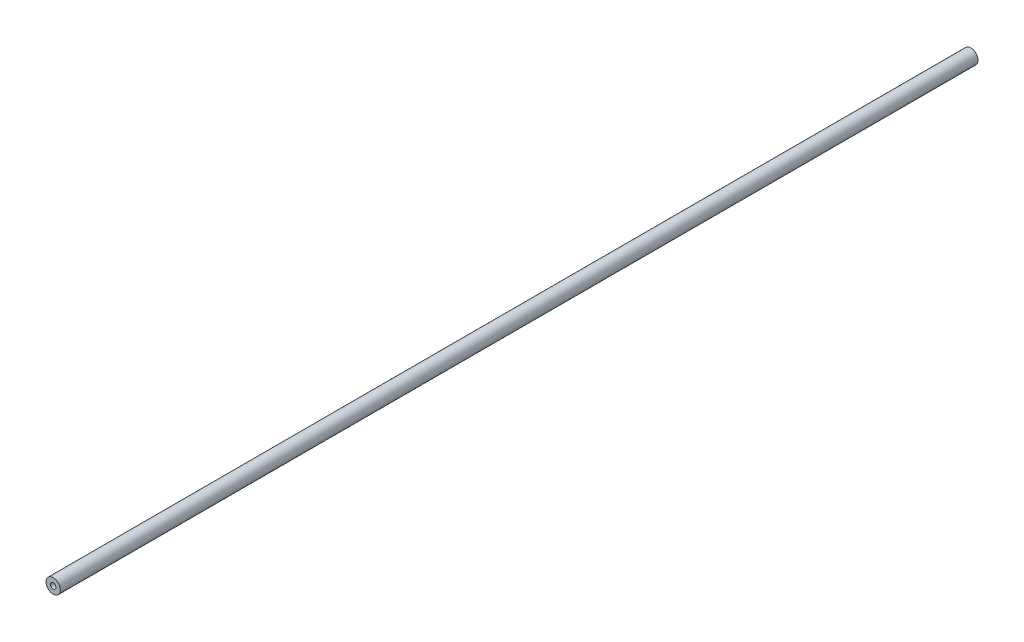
ISO-10303-21;
HEADER;
FILE_DESCRIPTION(('STEP AP214'),'2;1');
FILE_NAME('part.step','',(''),(''),'','','');
FILE_SCHEMA(('AUTOMOTIVE_DESIGN { 1 0 10303 214 1 1 1 1 }'));
ENDSEC;
DATA;
#1=APPLICATION_CONTEXT('core data for automotive mechanical design processes');
#2=APPLICATION_PROTOCOL_DEFINITION('international standard','automotive_design',2000,#1);
#3=PRODUCT_CONTEXT('',#1,'mechanical');
#4=PRODUCT('Part','Part','',(#3));
#5=PRODUCT_RELATED_PRODUCT_CATEGORY('part','',(#4));
#6=PRODUCT_DEFINITION_FORMATION('','',#4);
#7=PRODUCT_DEFINITION_CONTEXT('part definition',#1,'design');
#8=PRODUCT_DEFINITION('design','',#6,#7);
#9=PRODUCT_DEFINITION_SHAPE('','',#8);
#10=(LENGTH_UNIT() NAMED_UNIT(*) SI_UNIT(.MILLI.,.METRE.));
#11=(NAMED_UNIT(*) PLANE_ANGLE_UNIT() SI_UNIT($,.RADIAN.));
#12=(NAMED_UNIT(*) SI_UNIT($,.STERADIAN.) SOLID_ANGLE_UNIT());
#13=UNCERTAINTY_MEASURE_WITH_UNIT(LENGTH_MEASURE(1.E-05),#10,'distance_accuracy_value','');
#14=(GEOMETRIC_REPRESENTATION_CONTEXT(3) GLOBAL_UNCERTAINTY_ASSIGNED_CONTEXT((#13)) GLOBAL_UNIT_ASSIGNED_CONTEXT((#10,
#11,#12)) REPRESENTATION_CONTEXT('',''));
#15=CARTESIAN_POINT('',(0.,0.,0.));
#16=DIRECTION('',(0.,0.,1.));
#17=DIRECTION('',(1.,0.,0.));
#18=AXIS2_PLACEMENT_3D('',#15,#16,#17);
#19=CARTESIAN_POINT('',(0.,0.,609.6));
#20=DIRECTION('',(0.,0.,1.));
#21=DIRECTION('',(1.,0.,0.));
#22=AXIS2_PLACEMENT_3D('',#19,#20,#21);
#23=PLANE('',#22);
#24=CARTESIAN_POINT('',(0.,0.,609.6));
#25=DIRECTION('',(0.,0.,1.));
#26=DIRECTION('',(1.,0.,0.));
#27=AXIS2_PLACEMENT_3D('',#24,#25,#26);
#28=CIRCLE('',#27,4.7625);
#29=CARTESIAN_POINT('',(-4.7625,0.,609.6));
#30=VERTEX_POINT('',#29);
#31=EDGE_CURVE('E10',#30,#30,#28,.T.);
#32=ORIENTED_EDGE('',*,*,#31,.T.);
#33=EDGE_LOOP('',(#32));
#34=FACE_BOUND('',#33,.T.);
#35=CARTESIAN_POINT('',(0.,0.,609.6));
#36=DIRECTION('',(0.,0.,1.));
#37=DIRECTION('',(1.,0.,0.));
#38=AXIS2_PLACEMENT_3D('',#35,#36,#37);
#39=CIRCLE('',#38,1.8415);
#40=CARTESIAN_POINT('',(-1.8415,0.,609.6));
#41=VERTEX_POINT('',#40);
#42=EDGE_CURVE('E44',#41,#41,#39,.T.);
#43=ORIENTED_EDGE('',*,*,#42,.F.);
#44=EDGE_LOOP('',(#43));
#45=FACE_BOUND('',#44,.T.);
#46=ADVANCED_FACE('F33',(#34,#45),#23,.T.);
#47=CARTESIAN_POINT('',(0.,0.,0.));
#48=DIRECTION('',(0.,0.,1.));
#49=DIRECTION('',(1.,0.,0.));
#50=AXIS2_PLACEMENT_3D('',#47,#48,#49);
#51=PLANE('',#50);
#52=CARTESIAN_POINT('',(0.,0.,0.));
#53=DIRECTION('',(0.,0.,1.));
#54=DIRECTION('',(1.,0.,0.));
#55=AXIS2_PLACEMENT_3D('',#52,#53,#54);
#56=CIRCLE('',#55,4.7625);
#57=CARTESIAN_POINT('',(-4.7625,0.,0.));
#58=VERTEX_POINT('',#57);
#59=EDGE_CURVE('E37',#58,#58,#56,.T.);
#60=ORIENTED_EDGE('',*,*,#59,.F.);
#61=EDGE_LOOP('',(#60));
#62=FACE_BOUND('',#61,.T.);
#63=CARTESIAN_POINT('',(0.,0.,0.));
#64=DIRECTION('',(0.,0.,1.));
#65=DIRECTION('',(1.,0.,0.));
#66=AXIS2_PLACEMENT_3D('',#63,#64,#65);
#67=CIRCLE('',#66,1.8415);
#68=CARTESIAN_POINT('',(-1.8415,0.,0.));
#69=VERTEX_POINT('',#68);
#70=EDGE_CURVE('E46',#69,#69,#67,.T.);
#71=ORIENTED_EDGE('',*,*,#70,.T.);
#72=EDGE_LOOP('',(#71));
#73=FACE_BOUND('',#72,.T.);
#74=ADVANCED_FACE('F56',(#62,#73),#51,.F.);
#75=CARTESIAN_POINT('',(0.,0.,609.6));
#76=DIRECTION('',(0.,0.,-1.));
#77=DIRECTION('',(-1.,0.,0.));
#78=AXIS2_PLACEMENT_3D('',#75,#76,#77);
#79=CYLINDRICAL_SURFACE('',#78,4.7625);
#80=CARTESIAN_POINT('',(-4.7625,0.,609.6));
#81=CARTESIAN_POINT('',(-4.7625,0.,603.25));
#82=CARTESIAN_POINT('',(-4.7625,0.,596.9));
#83=CARTESIAN_POINT('',(-4.7625,0.,584.2));
#84=CARTESIAN_POINT('',(-4.7625,0.,577.85));
#85=CARTESIAN_POINT('',(-4.7625,0.,565.15));
#86=CARTESIAN_POINT('',(-4.7625,0.,558.8));
#87=CARTESIAN_POINT('',(-4.7625,0.,546.1));
#88=CARTESIAN_POINT('',(-4.7625,0.,539.75));
#89=CARTESIAN_POINT('',(-4.7625,0.,527.05));
#90=CARTESIAN_POINT('',(-4.7625,0.,520.7));
#91=CARTESIAN_POINT('',(-4.7625,0.,508.));
#92=CARTESIAN_POINT('',(-4.7625,0.,501.65));
#93=CARTESIAN_POINT('',(-4.7625,0.,488.95));
#94=CARTESIAN_POINT('',(-4.7625,0.,482.6));
#95=CARTESIAN_POINT('',(-4.7625,0.,469.9));
#96=CARTESIAN_POINT('',(-4.7625,0.,463.55));
#97=CARTESIAN_POINT('',(-4.7625,0.,450.85));
#98=CARTESIAN_POINT('',(-4.7625,0.,444.5));
#99=CARTESIAN_POINT('',(-4.7625,0.,431.8));
#100=CARTESIAN_POINT('',(-4.7625,0.,425.45));
#101=CARTESIAN_POINT('',(-4.7625,0.,412.75));
#102=CARTESIAN_POINT('',(-4.7625,0.,406.4));
#103=CARTESIAN_POINT('',(-4.7625,0.,393.7));
#104=CARTESIAN_POINT('',(-4.7625,0.,387.35));
#105=CARTESIAN_POINT('',(-4.7625,0.,374.65));
#106=CARTESIAN_POINT('',(-4.7625,0.,368.3));
#107=CARTESIAN_POINT('',(-4.7625,0.,355.6));
#108=CARTESIAN_POINT('',(-4.7625,0.,349.25));
#109=CARTESIAN_POINT('',(-4.7625,0.,336.55));
#110=CARTESIAN_POINT('',(-4.7625,0.,330.2));
#111=CARTESIAN_POINT('',(-4.7625,0.,317.5));
#112=CARTESIAN_POINT('',(-4.7625,0.,311.15));
#113=CARTESIAN_POINT('',(-4.7625,0.,298.45));
#114=CARTESIAN_POINT('',(-4.7625,0.,292.1));
#115=CARTESIAN_POINT('',(-4.7625,0.,279.4));
#116=CARTESIAN_POINT('',(-4.7625,0.,273.05));
#117=CARTESIAN_POINT('',(-4.7625,0.,260.35));
#118=CARTESIAN_POINT('',(-4.7625,0.,254.));
#119=CARTESIAN_POINT('',(-4.7625,0.,241.3));
#120=CARTESIAN_POINT('',(-4.7625,0.,234.95));
#121=CARTESIAN_POINT('',(-4.7625,0.,222.25));
#122=CARTESIAN_POINT('',(-4.7625,0.,215.9));
#123=CARTESIAN_POINT('',(-4.7625,0.,203.2));
#124=CARTESIAN_POINT('',(-4.7625,0.,196.85));
#125=CARTESIAN_POINT('',(-4.7625,0.,184.15));
#126=CARTESIAN_POINT('',(-4.7625,0.,177.8));
#127=CARTESIAN_POINT('',(-4.7625,0.,165.1));
#128=CARTESIAN_POINT('',(-4.7625,0.,158.75));
#129=CARTESIAN_POINT('',(-4.7625,0.,146.05));
#130=CARTESIAN_POINT('',(-4.7625,0.,139.7));
#131=CARTESIAN_POINT('',(-4.7625,0.,127.));
#132=CARTESIAN_POINT('',(-4.7625,0.,120.65));
#133=CARTESIAN_POINT('',(-4.7625,0.,107.95));
#134=CARTESIAN_POINT('',(-4.7625,0.,101.6));
#135=CARTESIAN_POINT('',(-4.7625,0.,88.9));
#136=CARTESIAN_POINT('',(-4.7625,0.,82.5500000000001));
#137=CARTESIAN_POINT('',(-4.7625,0.,69.85));
#138=CARTESIAN_POINT('',(-4.7625,0.,63.5));
#139=CARTESIAN_POINT('',(-4.7625,0.,50.8));
#140=CARTESIAN_POINT('',(-4.7625,0.,44.45));
#141=CARTESIAN_POINT('',(-4.7625,0.,31.75));
#142=CARTESIAN_POINT('',(-4.7625,0.,25.4));
#143=CARTESIAN_POINT('',(-4.7625,0.,12.7));
#144=CARTESIAN_POINT('',(-4.7625,0.,6.35000000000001));
#145=CARTESIAN_POINT('',(-4.7625,0.,0.));
#146=B_SPLINE_CURVE_WITH_KNOTS('',3,(#80,#81,#82,#83,#84,#85,#86,#87,#88,#89,#90,#91,#92,#93,
#94,#95,#96,#97,#98,#99,#100,#101,#102,#103,#104,#105,#106,#107,#108,#109,#110,#111,#112,#113,
#114,#115,#116,#117,#118,#119,#120,#121,#122,#123,#124,#125,#126,#127,#128,#129,#130,#131,#132,
#133,#134,#135,#136,#137,#138,#139,#140,#141,#142,#143,#144,#145),.UNSPECIFIED.,.F.,.F.,(4,2,2,
2,2,2,2,2,2,2,2,2,2,2,2,2,2,2,2,2,2,2,2,2,2,2,2,2,2,2,2,2,4),(0.,19.0499999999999,
38.0999999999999,57.1499999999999,76.1999999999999,95.2499999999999,114.3,133.35,152.4,171.45,
190.5,209.55,228.6,247.65,266.7,285.75,304.8,323.85,342.9,361.95,381.,400.05,419.1,438.15,457.2,
476.25,495.3,514.35,533.4,552.45,571.5,590.55,609.6),.UNSPECIFIED.);
#147=EDGE_CURVE('BSEAM35',#30,#58,#146,.T.);
#148=ORIENTED_EDGE('',*,*,#31,.F.);
#149=ORIENTED_EDGE('',*,*,#59,.T.);
#150=ORIENTED_EDGE('',*,*,#147,.T.);
#151=ORIENTED_EDGE('',*,*,#147,.F.);
#152=EDGE_LOOP('',(#148,#150,#149,#151));
#153=FACE_BOUND('',#152,.T.);
#154=ADVANCED_FACE('F35',(#153),#79,.T.);
#155=CARTESIAN_POINT('',(0.,0.,609.6));
#156=DIRECTION('',(0.,0.,-1.));
#157=DIRECTION('',(-1.,0.,0.));
#158=AXIS2_PLACEMENT_3D('',#155,#156,#157);
#159=CYLINDRICAL_SURFACE('',#158,1.8415);
#160=CARTESIAN_POINT('',(-1.8415,0.,609.6));
#161=CARTESIAN_POINT('',(-1.8415,0.,603.25));
#162=CARTESIAN_POINT('',(-1.8415,0.,596.9));
#163=CARTESIAN_POINT('',(-1.8415,0.,584.2));
#164=CARTESIAN_POINT('',(-1.8415,0.,577.85));
#165=CARTESIAN_POINT('',(-1.8415,0.,565.15));
#166=CARTESIAN_POINT('',(-1.8415,0.,558.8));
#167=CARTESIAN_POINT('',(-1.8415,0.,546.1));
#168=CARTESIAN_POINT('',(-1.8415,0.,539.75));
#169=CARTESIAN_POINT('',(-1.8415,0.,527.05));
#170=CARTESIAN_POINT('',(-1.8415,0.,520.7));
#171=CARTESIAN_POINT('',(-1.8415,0.,508.));
#172=CARTESIAN_POINT('',(-1.8415,0.,501.65));
#173=CARTESIAN_POINT('',(-1.8415,0.,488.95));
#174=CARTESIAN_POINT('',(-1.8415,0.,482.6));
#175=CARTESIAN_POINT('',(-1.8415,0.,469.9));
#176=CARTESIAN_POINT('',(-1.8415,0.,463.55));
#177=CARTESIAN_POINT('',(-1.8415,0.,450.85));
#178=CARTESIAN_POINT('',(-1.8415,0.,444.5));
#179=CARTESIAN_POINT('',(-1.8415,0.,431.8));
#180=CARTESIAN_POINT('',(-1.8415,0.,425.45));
#181=CARTESIAN_POINT('',(-1.8415,0.,412.75));
#182=CARTESIAN_POINT('',(-1.8415,0.,406.4));
#183=CARTESIAN_POINT('',(-1.8415,0.,393.7));
#184=CARTESIAN_POINT('',(-1.8415,0.,387.35));
#185=CARTESIAN_POINT('',(-1.8415,0.,374.65));
#186=CARTESIAN_POINT('',(-1.8415,0.,368.3));
#187=CARTESIAN_POINT('',(-1.8415,0.,355.6));
#188=CARTESIAN_POINT('',(-1.8415,0.,349.25));
#189=CARTESIAN_POINT('',(-1.8415,0.,336.55));
#190=CARTESIAN_POINT('',(-1.8415,0.,330.2));
#191=CARTESIAN_POINT('',(-1.8415,0.,317.5));
#192=CARTESIAN_POINT('',(-1.8415,0.,311.15));
#193=CARTESIAN_POINT('',(-1.8415,0.,298.45));
#194=CARTESIAN_POINT('',(-1.8415,0.,292.1));
#195=CARTESIAN_POINT('',(-1.8415,0.,279.4));
#196=CARTESIAN_POINT('',(-1.8415,0.,273.05));
#197=CARTESIAN_POINT('',(-1.8415,0.,260.35));
#198=CARTESIAN_POINT('',(-1.8415,0.,254.));
#199=CARTESIAN_POINT('',(-1.8415,0.,241.3));
#200=CARTESIAN_POINT('',(-1.8415,0.,234.95));
#201=CARTESIAN_POINT('',(-1.8415,0.,222.25));
#202=CARTESIAN_POINT('',(-1.8415,0.,215.9));
#203=CARTESIAN_POINT('',(-1.8415,0.,203.2));
#204=CARTESIAN_POINT('',(-1.8415,0.,196.85));
#205=CARTESIAN_POINT('',(-1.8415,0.,184.15));
#206=CARTESIAN_POINT('',(-1.8415,0.,177.8));
#207=CARTESIAN_POINT('',(-1.8415,0.,165.1));
#208=CARTESIAN_POINT('',(-1.8415,0.,158.75));
#209=CARTESIAN_POINT('',(-1.8415,0.,146.05));
#210=CARTESIAN_POINT('',(-1.8415,0.,139.7));
#211=CARTESIAN_POINT('',(-1.8415,0.,127.));
#212=CARTESIAN_POINT('',(-1.8415,0.,120.65));
#213=CARTESIAN_POINT('',(-1.8415,0.,107.95));
#214=CARTESIAN_POINT('',(-1.8415,0.,101.6));
#215=CARTESIAN_POINT('',(-1.8415,0.,88.9));
#216=CARTESIAN_POINT('',(-1.8415,0.,82.5500000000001));
#217=CARTESIAN_POINT('',(-1.8415,0.,69.85));
#218=CARTESIAN_POINT('',(-1.8415,0.,63.5));
#219=CARTESIAN_POINT('',(-1.8415,0.,50.8));
#220=CARTESIAN_POINT('',(-1.8415,0.,44.45));
#221=CARTESIAN_POINT('',(-1.8415,0.,31.75));
#222=CARTESIAN_POINT('',(-1.8415,0.,25.4));
#223=CARTESIAN_POINT('',(-1.8415,0.,12.7));
#224=CARTESIAN_POINT('',(-1.8415,0.,6.35000000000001));
#225=CARTESIAN_POINT('',(-1.8415,0.,0.));
#226=B_SPLINE_CURVE_WITH_KNOTS('',3,(#160,#161,#162,#163,#164,#165,#166,#167,#168,#169,#170,
#171,#172,#173,#174,#175,#176,#177,#178,#179,#180,#181,#182,#183,#184,#185,#186,#187,#188,#189,
#190,#191,#192,#193,#194,#195,#196,#197,#198,#199,#200,#201,#202,#203,#204,#205,#206,#207,#208,
#209,#210,#211,#212,#213,#214,#215,#216,#217,#218,#219,#220,#221,#222,#223,#224,#225),
.UNSPECIFIED.,.F.,.F.,(4,2,2,2,2,2,2,2,2,2,2,2,2,2,2,2,2,2,2,2,2,2,2,2,2,2,2,2,2,2,2,2,4),(0.,
19.05,38.1,57.15,76.2,95.2500000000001,114.3,133.35,152.4,171.45,190.5,209.55,228.6,247.65,
266.7,285.75,304.8,323.85,342.9,361.95,381.,400.05,419.1,438.15,457.2,476.25,495.3,514.35,533.4,
552.45,571.5,590.55,609.6),.UNSPECIFIED.);
#227=EDGE_CURVE('BSEAM52',#41,#69,#226,.T.);
#228=ORIENTED_EDGE('',*,*,#42,.T.);
#229=ORIENTED_EDGE('',*,*,#70,.F.);
#230=ORIENTED_EDGE('',*,*,#227,.T.);
#231=ORIENTED_EDGE('',*,*,#227,.F.);
#232=EDGE_LOOP('',(#228,#230,#229,#231));
#233=FACE_BOUND('',#232,.T.);
#234=ADVANCED_FACE('F52',(#233),#159,.F.);
#235=CLOSED_SHELL('',(#46,#74,#154,#234));
#236=MANIFOLD_SOLID_BREP('B2',#235);
#237=ADVANCED_BREP_SHAPE_REPRESENTATION('',(#18,#236),#14);
#238=SHAPE_DEFINITION_REPRESENTATION(#9,#237);
ENDSEC;
END-ISO-10303-21;
